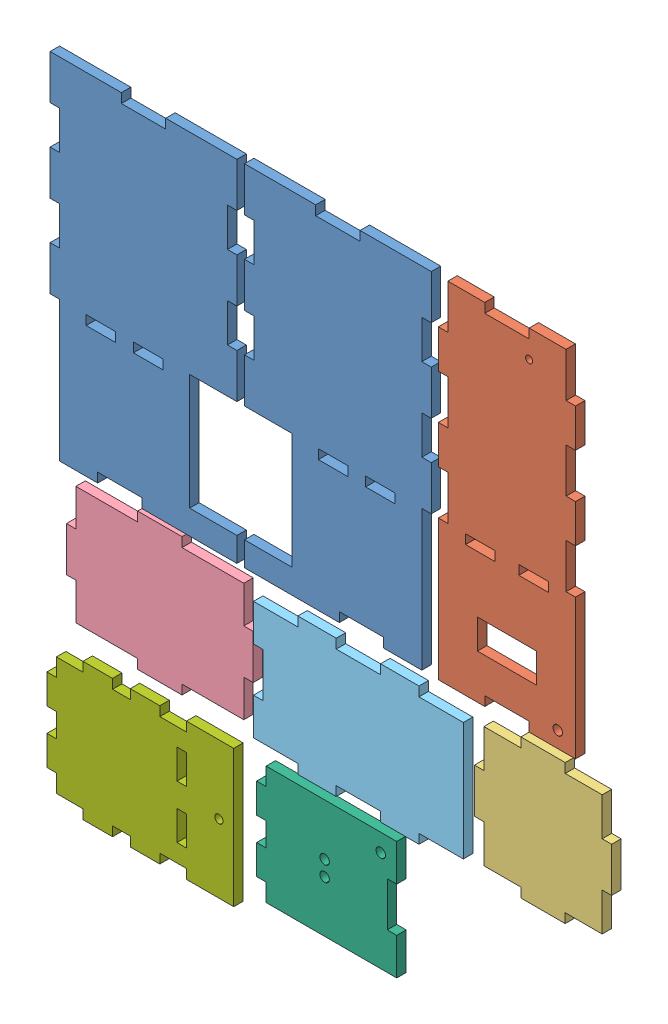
SolidWorks assembly Assem_for_v_carve.SLDASM, configuration Default (file format 9000). Lengths in mm.
Overall size (949.86 1081.61 40).
8 component instances, 7 part files, 5 mates.
Components (placement in the parent):
- Part3-1: Part3.SLDPRT [Default] at (429.7187 -96.6604 592) size (316 592 16)
- Part3-2: Part3.SLDPRT [Default] at (224.9154 -96.6604 608) x (-1 0 0) z (0 0 -1) size (316 592 16)
- Part2-1: Part2.SLDPRT [Default] at (673.7115 -96.6604 592) size (232 592 16)
- Part6-1: Part6.SLDPRT [Default] at (738.7725 -387.6513 592) size (232 236 16)
- Part7-2: Part7.SLDPRT [Default] at (324.5264 -384.8991 584) x (0 1 0) z (0 0 1) size (232 316 16)
- Part1-2: Part1.SLDPRT [Default] at (711.9273 -403.1548 600) x (0 1 0) z (0 0 1) size (232 355 16)
- Part5-2: Part5.SLDPRT [Default] at (591.2757 -625.8088 592) x (0 1 0) z (0 0 1) size (200 237 16)
- Part4-2: Part4.SLDPRT [Default] at (331.5298 -627.2708 624) x (0 1 0) z (0 0 1) size (232 316 16)
Mates (geometry in assembly coordinates):
- Coincident1: coincident aligned: plane of Part3-1 through (429.7187 -96.6604 608) normal (0 0 1); plane of Part3-2 through (224.9154 -96.6604 608) normal (0 0 1)
- Coincident4: coincident aligned: plane of Part3-2 through (224.9154 -96.6604 608) normal (0 0 1); plane of Part6-1 through (738.7725 -387.6513 608) normal (0 0 1)
- Coincident5: coincident aligned: plane of Part3-1 through (429.7187 -96.6604 608) normal (0 0 1); plane of Part2-1 through (673.7115 -96.6604 608) normal (0 0 1)
- Coincident8: coincident aligned: plane of Part3-1 through (429.7187 -153.6604 608) normal (0 -1 0); plane of Part2-1 through (740.2115 -153.6604 608) normal (0 -1 0)
- Coincident9: coincident aligned: plane of Part3-1 through (429.7187 -153.6604 608) normal (0 -1 0); plane of Part3-2 through (224.9154 -153.6604 592) normal (0 -1 0)
